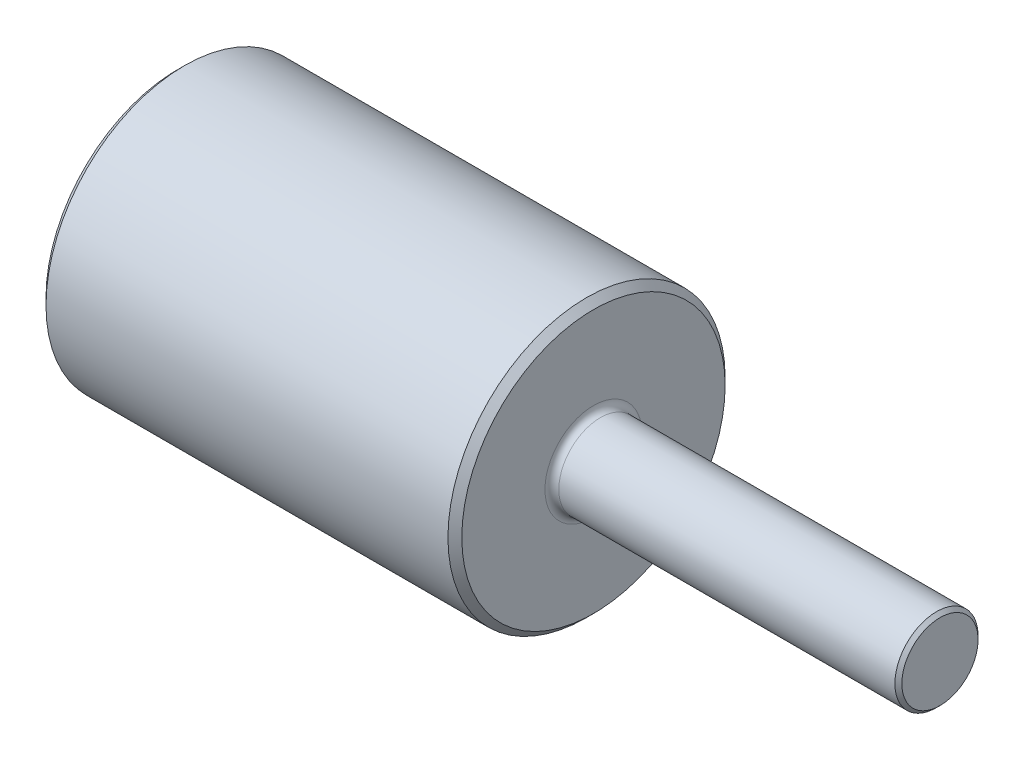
ISO-10303-21;
HEADER;
FILE_DESCRIPTION(('STEP AP214'),'2;1');
FILE_NAME('part.step','',(''),(''),'','','');
FILE_SCHEMA(('AUTOMOTIVE_DESIGN { 1 0 10303 214 1 1 1 1 }'));
ENDSEC;
DATA;
#1=APPLICATION_CONTEXT('core data for automotive mechanical design processes');
#2=APPLICATION_PROTOCOL_DEFINITION('international standard','automotive_design',2000,#1);
#3=PRODUCT_CONTEXT('',#1,'mechanical');
#4=PRODUCT('Part','Part','',(#3));
#5=PRODUCT_RELATED_PRODUCT_CATEGORY('part','',(#4));
#6=PRODUCT_DEFINITION_FORMATION('','',#4);
#7=PRODUCT_DEFINITION_CONTEXT('part definition',#1,'design');
#8=PRODUCT_DEFINITION('design','',#6,#7);
#9=PRODUCT_DEFINITION_SHAPE('','',#8);
#10=(LENGTH_UNIT() NAMED_UNIT(*) SI_UNIT(.MILLI.,.METRE.));
#11=(NAMED_UNIT(*) PLANE_ANGLE_UNIT() SI_UNIT($,.RADIAN.));
#12=(NAMED_UNIT(*) SI_UNIT($,.STERADIAN.) SOLID_ANGLE_UNIT());
#13=UNCERTAINTY_MEASURE_WITH_UNIT(LENGTH_MEASURE(1.E-05),#10,'distance_accuracy_value','');
#14=(GEOMETRIC_REPRESENTATION_CONTEXT(3) GLOBAL_UNCERTAINTY_ASSIGNED_CONTEXT((#13)) GLOBAL_UNIT_ASSIGNED_CONTEXT((#10,
#11,#12)) REPRESENTATION_CONTEXT('',''));
#15=CARTESIAN_POINT('',(0.,0.,0.));
#16=DIRECTION('',(0.,0.,1.));
#17=DIRECTION('',(1.,0.,0.));
#18=AXIS2_PLACEMENT_3D('',#15,#16,#17);
#19=CARTESIAN_POINT('',(0.,0.,0.));
#20=DIRECTION('',(-1.,0.,0.));
#21=DIRECTION('',(0.,0.,1.));
#22=AXIS2_PLACEMENT_3D('',#19,#20,#21);
#23=PLANE('',#22);
#24=CARTESIAN_POINT('',(0.,0.,0.));
#25=DIRECTION('',(-1.,0.,0.));
#26=DIRECTION('',(0.,0.,1.));
#27=AXIS2_PLACEMENT_3D('',#24,#25,#26);
#28=CIRCLE('',#27,2.74999999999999);
#29=CARTESIAN_POINT('',(0.,0.,2.74999999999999));
#30=VERTEX_POINT('',#29);
#31=EDGE_CURVE('E57',#30,#30,#28,.F.);
#32=ORIENTED_EDGE('',*,*,#31,.T.);
#33=EDGE_LOOP('',(#32));
#34=FACE_BOUND('',#33,.T.);
#35=ADVANCED_FACE('F32',(#34),#23,.F.);
#36=CARTESIAN_POINT('',(-58.6699153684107,0.,0.));
#37=DIRECTION('',(-1.,0.,0.));
#38=DIRECTION('',(0.,0.,1.));
#39=AXIS2_PLACEMENT_3D('',#36,#37,#38);
#40=CYLINDRICAL_SURFACE('',#39,3.);
#41=CARTESIAN_POINT('',(-24.5,0.,0.));
#42=DIRECTION('',(-1.,0.,0.));
#43=DIRECTION('',(0.,0.,1.));
#44=AXIS2_PLACEMENT_3D('',#41,#42,#43);
#45=CIRCLE('',#44,3.);
#46=CARTESIAN_POINT('',(-24.5,0.,3.));
#47=VERTEX_POINT('',#46);
#48=EDGE_CURVE('E10',#47,#47,#45,.F.);
#49=ORIENTED_EDGE('',*,*,#48,.T.);
#50=EDGE_LOOP('',(#49));
#51=FACE_BOUND('',#50,.T.);
#52=CARTESIAN_POINT('',(-0.250000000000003,0.,0.));
#53=DIRECTION('',(-1.,0.,0.));
#54=DIRECTION('',(0.,0.,1.));
#55=AXIS2_PLACEMENT_3D('',#52,#53,#54);
#56=CIRCLE('',#55,3.);
#57=CARTESIAN_POINT('',(-0.250000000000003,0.,3.));
#58=VERTEX_POINT('',#57);
#59=EDGE_CURVE('E60',#58,#58,#56,.T.);
#60=ORIENTED_EDGE('',*,*,#59,.T.);
#61=EDGE_LOOP('',(#60));
#62=FACE_BOUND('',#61,.T.);
#63=ADVANCED_FACE('F64',(#51,#62),#40,.T.);
#64=CARTESIAN_POINT('',(-25.,3.,0.));
#65=DIRECTION('',(-1.,0.,0.));
#66=DIRECTION('',(0.,0.,1.));
#67=AXIS2_PLACEMENT_3D('',#64,#65,#66);
#68=PLANE('',#67);
#69=CARTESIAN_POINT('',(-25.,0.,0.));
#70=DIRECTION('',(-1.,0.,0.));
#71=DIRECTION('',(0.,0.,1.));
#72=AXIS2_PLACEMENT_3D('',#69,#70,#71);
#73=CIRCLE('',#72,3.5);
#74=CARTESIAN_POINT('',(-25.,0.,3.5));
#75=VERTEX_POINT('',#74);
#76=EDGE_CURVE('E38',#75,#75,#73,.T.);
#77=ORIENTED_EDGE('',*,*,#76,.T.);
#78=EDGE_LOOP('',(#77));
#79=FACE_BOUND('',#78,.T.);
#80=CARTESIAN_POINT('',(-25.,0.,0.));
#81=DIRECTION('',(-1.,0.,0.));
#82=DIRECTION('',(0.,0.,1.));
#83=AXIS2_PLACEMENT_3D('',#80,#81,#82);
#84=CIRCLE('',#83,9.5);
#85=CARTESIAN_POINT('',(-25.,0.,9.5));
#86=VERTEX_POINT('',#85);
#87=EDGE_CURVE('E46',#86,#86,#84,.F.);
#88=ORIENTED_EDGE('',*,*,#87,.T.);
#89=EDGE_LOOP('',(#88));
#90=FACE_BOUND('',#89,.T.);
#91=ADVANCED_FACE('F88',(#79,#90),#68,.F.);
#92=CARTESIAN_POINT('',(-58.6699153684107,0.,0.));
#93=DIRECTION('',(-1.,0.,0.));
#94=DIRECTION('',(0.,0.,1.));
#95=AXIS2_PLACEMENT_3D('',#92,#93,#94);
#96=CYLINDRICAL_SURFACE('',#95,10.);
#97=CARTESIAN_POINT('',(-25.5,0.,0.));
#98=DIRECTION('',(-1.,0.,0.));
#99=DIRECTION('',(0.,0.,1.));
#100=AXIS2_PLACEMENT_3D('',#97,#98,#99);
#101=CIRCLE('',#100,10.);
#102=CARTESIAN_POINT('',(-25.5,0.,10.));
#103=VERTEX_POINT('',#102);
#104=EDGE_CURVE('E51',#103,#103,#101,.T.);
#105=ORIENTED_EDGE('',*,*,#104,.T.);
#106=EDGE_LOOP('',(#105));
#107=FACE_BOUND('',#106,.T.);
#108=CARTESIAN_POINT('',(-54.5,0.,0.));
#109=DIRECTION('',(1.,0.,0.));
#110=DIRECTION('',(0.,0.,-1.));
#111=AXIS2_PLACEMENT_3D('',#108,#109,#110);
#112=CIRCLE('',#111,10.);
#113=CARTESIAN_POINT('',(-54.5,0.,-10.));
#114=VERTEX_POINT('',#113);
#115=EDGE_CURVE('E54',#114,#114,#112,.T.);
#116=ORIENTED_EDGE('',*,*,#115,.T.);
#117=EDGE_LOOP('',(#116));
#118=FACE_BOUND('',#117,.T.);
#119=ADVANCED_FACE('F79',(#107,#118),#96,.T.);
#120=CARTESIAN_POINT('',(-55.,10.,0.));
#121=DIRECTION('',(1.,0.,0.));
#122=DIRECTION('',(0.,0.,-1.));
#123=AXIS2_PLACEMENT_3D('',#120,#121,#122);
#124=PLANE('',#123);
#125=CARTESIAN_POINT('',(-55.,0.,0.));
#126=DIRECTION('',(1.,0.,0.));
#127=DIRECTION('',(0.,0.,-1.));
#128=AXIS2_PLACEMENT_3D('',#125,#126,#127);
#129=CIRCLE('',#128,9.49999999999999);
#130=CARTESIAN_POINT('',(-55.,0.,-9.49999999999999));
#131=VERTEX_POINT('',#130);
#132=EDGE_CURVE('E42',#131,#131,#129,.F.);
#133=ORIENTED_EDGE('',*,*,#132,.T.);
#134=EDGE_LOOP('',(#133));
#135=FACE_BOUND('',#134,.T.);
#136=ADVANCED_FACE('F69',(#135),#124,.F.);
#137=CARTESIAN_POINT('',(-0.250000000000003,0.,0.));
#138=DIRECTION('',(-1.,0.,0.));
#139=DIRECTION('',(0.,0.,1.));
#140=AXIS2_PLACEMENT_3D('',#137,#138,#139);
#141=CONICAL_SURFACE('',#140,3.,0.78539816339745);
#142=ORIENTED_EDGE('',*,*,#31,.F.);
#143=EDGE_LOOP('',(#142));
#144=FACE_BOUND('',#143,.T.);
#145=ORIENTED_EDGE('',*,*,#59,.F.);
#146=EDGE_LOOP('',(#145));
#147=FACE_BOUND('',#146,.T.);
#148=ADVANCED_FACE('F66',(#144,#147),#141,.T.);
#149=CARTESIAN_POINT('',(-25.5,0.,0.));
#150=DIRECTION('',(-1.,0.,0.));
#151=DIRECTION('',(0.,0.,1.));
#152=AXIS2_PLACEMENT_3D('',#149,#150,#151);
#153=CONICAL_SURFACE('',#152,10.,0.785398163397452);
#154=ORIENTED_EDGE('',*,*,#87,.F.);
#155=EDGE_LOOP('',(#154));
#156=FACE_BOUND('',#155,.T.);
#157=ORIENTED_EDGE('',*,*,#104,.F.);
#158=EDGE_LOOP('',(#157));
#159=FACE_BOUND('',#158,.T.);
#160=ADVANCED_FACE('F68',(#156,#159),#153,.T.);
#161=CARTESIAN_POINT('',(-55.,0.,0.));
#162=DIRECTION('',(1.,0.,0.));
#163=DIRECTION('',(0.,0.,-1.));
#164=AXIS2_PLACEMENT_3D('',#161,#162,#163);
#165=CONICAL_SURFACE('',#164,9.49999999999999,0.785398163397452);
#166=ORIENTED_EDGE('',*,*,#115,.F.);
#167=EDGE_LOOP('',(#166));
#168=FACE_BOUND('',#167,.T.);
#169=ORIENTED_EDGE('',*,*,#132,.F.);
#170=EDGE_LOOP('',(#169));
#171=FACE_BOUND('',#170,.T.);
#172=ADVANCED_FACE('F76',(#168,#171),#165,.T.);
#173=CARTESIAN_POINT('',(-24.5,0.,0.));
#174=DIRECTION('',(-1.,0.,0.));
#175=DIRECTION('',(0.,0.,1.));
#176=AXIS2_PLACEMENT_3D('',#173,#174,#175);
#177=TOROIDAL_SURFACE('',#176,3.5,0.5);
#178=ORIENTED_EDGE('',*,*,#48,.F.);
#179=EDGE_LOOP('',(#178));
#180=FACE_BOUND('',#179,.T.);
#181=ORIENTED_EDGE('',*,*,#76,.F.);
#182=EDGE_LOOP('',(#181));
#183=FACE_BOUND('',#182,.T.);
#184=ADVANCED_FACE('F104',(#180,#183),#177,.F.);
#185=CLOSED_SHELL('',(#35,#63,#91,#119,#136,#148,#160,#172,#184));
#186=MANIFOLD_SOLID_BREP('B2',#185);
#187=ADVANCED_BREP_SHAPE_REPRESENTATION('',(#18,#186),#14);
#188=SHAPE_DEFINITION_REPRESENTATION(#9,#187);
ENDSEC;
END-ISO-10303-21;
